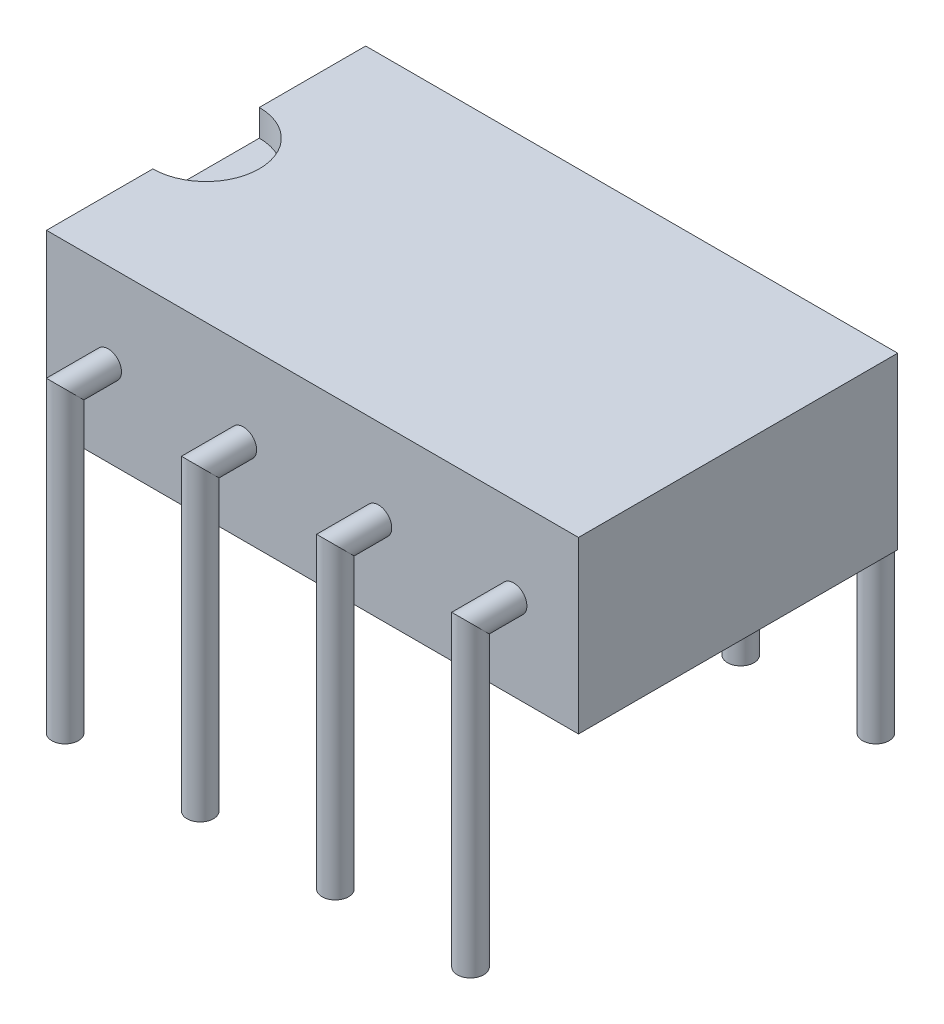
ISO-10303-21;
HEADER;
FILE_DESCRIPTION(('STEP AP214'),'2;1');
FILE_NAME('part.step','',(''),(''),'','','');
FILE_SCHEMA(('AUTOMOTIVE_DESIGN { 1 0 10303 214 1 1 1 1 }'));
ENDSEC;
DATA;
#1=APPLICATION_CONTEXT('core data for automotive mechanical design processes');
#2=APPLICATION_PROTOCOL_DEFINITION('international standard','automotive_design',2000,#1);
#3=PRODUCT_CONTEXT('',#1,'mechanical');
#4=PRODUCT('Part','Part','',(#3));
#5=PRODUCT_RELATED_PRODUCT_CATEGORY('part','',(#4));
#6=PRODUCT_DEFINITION_FORMATION('','',#4);
#7=PRODUCT_DEFINITION_CONTEXT('part definition',#1,'design');
#8=PRODUCT_DEFINITION('design','',#6,#7);
#9=PRODUCT_DEFINITION_SHAPE('','',#8);
#10=(LENGTH_UNIT() NAMED_UNIT(*) SI_UNIT(.MILLI.,.METRE.));
#11=(NAMED_UNIT(*) PLANE_ANGLE_UNIT() SI_UNIT($,.RADIAN.));
#12=(NAMED_UNIT(*) SI_UNIT($,.STERADIAN.) SOLID_ANGLE_UNIT());
#13=UNCERTAINTY_MEASURE_WITH_UNIT(LENGTH_MEASURE(1.E-05),#10,'distance_accuracy_value','');
#14=(GEOMETRIC_REPRESENTATION_CONTEXT(3) GLOBAL_UNCERTAINTY_ASSIGNED_CONTEXT((#13)) GLOBAL_UNIT_ASSIGNED_CONTEXT((#10,
#11,#12)) REPRESENTATION_CONTEXT('',''));
#15=CARTESIAN_POINT('',(0.,0.,0.));
#16=DIRECTION('',(0.,0.,1.));
#17=DIRECTION('',(1.,0.,0.));
#18=AXIS2_PLACEMENT_3D('',#15,#16,#17);
#19=CARTESIAN_POINT('',(10.,3.2,3.));
#20=DIRECTION('',(0.,0.,-1.));
#21=DIRECTION('',(-1.,0.,0.));
#22=AXIS2_PLACEMENT_3D('',#19,#20,#21);
#23=PLANE('',#22);
#24=CARTESIAN_POINT('',(6.24,1.6,3.));
#25=DIRECTION('',(0.,0.,-1.));
#26=DIRECTION('',(-1.,0.,0.));
#27=AXIS2_PLACEMENT_3D('',#24,#25,#26);
#28=CIRCLE('',#27,0.25);
#29=CARTESIAN_POINT('',(5.99,1.6,3.));
#30=VERTEX_POINT('',#29);
#31=EDGE_CURVE('E47',#30,#30,#28,.F.);
#32=ORIENTED_EDGE('',*,*,#31,.F.);
#33=EDGE_LOOP('',(#32));
#34=FACE_BOUND('',#33,.T.);
#35=CARTESIAN_POINT('',(1.16,1.6,3.));
#36=DIRECTION('',(0.,0.,-1.));
#37=DIRECTION('',(-1.,0.,0.));
#38=AXIS2_PLACEMENT_3D('',#35,#36,#37);
#39=CIRCLE('',#38,0.25);
#40=CARTESIAN_POINT('',(0.91,1.6,3.));
#41=VERTEX_POINT('',#40);
#42=EDGE_CURVE('E144',#41,#41,#39,.F.);
#43=ORIENTED_EDGE('',*,*,#42,.F.);
#44=EDGE_LOOP('',(#43));
#45=FACE_BOUND('',#44,.T.);
#46=DIRECTION('',(0.,-1.,0.));
#47=VECTOR('',#46,1.);
#48=CARTESIAN_POINT('',(0.,3.2,3.));
#49=LINE('',#48,#47);
#50=CARTESIAN_POINT('',(0.,3.2,3.));
#51=VERTEX_POINT('',#50);
#52=CARTESIAN_POINT('',(0.,0.,3.));
#53=VERTEX_POINT('',#52);
#54=EDGE_CURVE('E114',#51,#53,#49,.T.);
#55=ORIENTED_EDGE('',*,*,#54,.T.);
#56=DIRECTION('',(-1.,0.,0.));
#57=VECTOR('',#56,1.);
#58=CARTESIAN_POINT('',(10.,0.,3.));
#59=LINE('',#58,#57);
#60=CARTESIAN_POINT('',(10.,0.,3.));
#61=VERTEX_POINT('',#60);
#62=EDGE_CURVE('E142',#61,#53,#59,.T.);
#63=ORIENTED_EDGE('',*,*,#62,.F.);
#64=DIRECTION('',(0.,-1.,0.));
#65=VECTOR('',#64,1.);
#66=CARTESIAN_POINT('',(10.,3.2,3.));
#67=LINE('',#66,#65);
#68=CARTESIAN_POINT('',(10.,3.2,3.));
#69=VERTEX_POINT('',#68);
#70=EDGE_CURVE('E122',#69,#61,#67,.T.);
#71=ORIENTED_EDGE('',*,*,#70,.F.);
#72=DIRECTION('',(-1.,0.,0.));
#73=VECTOR('',#72,1.);
#74=CARTESIAN_POINT('',(10.,3.2,3.));
#75=LINE('',#74,#73);
#76=EDGE_CURVE('E128',#69,#51,#75,.T.);
#77=ORIENTED_EDGE('',*,*,#76,.T.);
#78=EDGE_LOOP('',(#55,#63,#71,#77));
#79=FACE_BOUND('',#78,.T.);
#80=CARTESIAN_POINT('',(3.7,1.6,3.));
#81=DIRECTION('',(0.,0.,-1.));
#82=DIRECTION('',(-1.,0.,0.));
#83=AXIS2_PLACEMENT_3D('',#80,#81,#82);
#84=CIRCLE('',#83,0.25);
#85=CARTESIAN_POINT('',(3.45,1.6,3.));
#86=VERTEX_POINT('',#85);
#87=EDGE_CURVE('E147',#86,#86,#84,.F.);
#88=ORIENTED_EDGE('',*,*,#87,.F.);
#89=EDGE_LOOP('',(#88));
#90=FACE_BOUND('',#89,.T.);
#91=CARTESIAN_POINT('',(8.78,1.6,3.));
#92=DIRECTION('',(0.,0.,-1.));
#93=DIRECTION('',(-1.,0.,0.));
#94=AXIS2_PLACEMENT_3D('',#91,#92,#93);
#95=CIRCLE('',#94,0.25);
#96=CARTESIAN_POINT('',(8.53,1.6,3.));
#97=VERTEX_POINT('',#96);
#98=EDGE_CURVE('E12',#97,#97,#95,.F.);
#99=ORIENTED_EDGE('',*,*,#98,.F.);
#100=EDGE_LOOP('',(#99));
#101=FACE_BOUND('',#100,.T.);
#102=ADVANCED_FACE('F40',(#34,#45,#79,#90,#101),#23,.F.);
#103=CARTESIAN_POINT('',(10.,0.,3.));
#104=DIRECTION('',(0.,1.,0.));
#105=DIRECTION('',(0.,0.,1.));
#106=AXIS2_PLACEMENT_3D('',#103,#104,#105);
#107=PLANE('',#106);
#108=DIRECTION('',(0.,0.,-1.));
#109=VECTOR('',#108,1.);
#110=CARTESIAN_POINT('',(0.,0.,3.));
#111=LINE('',#110,#109);
#112=CARTESIAN_POINT('',(0.,0.,-3.));
#113=VERTEX_POINT('',#112);
#114=EDGE_CURVE('E117',#53,#113,#111,.T.);
#115=ORIENTED_EDGE('',*,*,#114,.T.);
#116=DIRECTION('',(-1.,0.,0.));
#117=VECTOR('',#116,1.);
#118=CARTESIAN_POINT('',(10.,0.,-3.));
#119=LINE('',#118,#117);
#120=CARTESIAN_POINT('',(10.,0.,-3.));
#121=VERTEX_POINT('',#120);
#122=EDGE_CURVE('E139',#121,#113,#119,.T.);
#123=ORIENTED_EDGE('',*,*,#122,.F.);
#124=DIRECTION('',(0.,0.,-1.));
#125=VECTOR('',#124,1.);
#126=CARTESIAN_POINT('',(10.,0.,3.));
#127=LINE('',#126,#125);
#128=EDGE_CURVE('E91',#61,#121,#127,.T.);
#129=ORIENTED_EDGE('',*,*,#128,.F.);
#130=ORIENTED_EDGE('',*,*,#62,.T.);
#131=EDGE_LOOP('',(#115,#123,#129,#130));
#132=FACE_BOUND('',#131,.T.);
#133=ADVANCED_FACE('F157',(#132),#107,.F.);
#134=CARTESIAN_POINT('',(10.,3.2,-3.));
#135=DIRECTION('',(0.,0.,1.));
#136=DIRECTION('',(1.,0.,0.));
#137=AXIS2_PLACEMENT_3D('',#134,#135,#136);
#138=PLANE('',#137);
#139=CARTESIAN_POINT('',(8.78,1.6,-3.));
#140=DIRECTION('',(0.,0.,1.));
#141=DIRECTION('',(1.,0.,0.));
#142=AXIS2_PLACEMENT_3D('',#139,#140,#141);
#143=CIRCLE('',#142,0.25);
#144=CARTESIAN_POINT('',(9.03,1.6,-3.));
#145=VERTEX_POINT('',#144);
#146=EDGE_CURVE('E521',#145,#145,#143,.T.);
#147=ORIENTED_EDGE('',*,*,#146,.T.);
#148=EDGE_LOOP('',(#147));
#149=FACE_BOUND('',#148,.T.);
#150=CARTESIAN_POINT('',(6.24,1.6,-3.));
#151=DIRECTION('',(0.,0.,1.));
#152=DIRECTION('',(1.,0.,0.));
#153=AXIS2_PLACEMENT_3D('',#150,#151,#152);
#154=CIRCLE('',#153,0.25);
#155=CARTESIAN_POINT('',(6.49,1.6,-3.));
#156=VERTEX_POINT('',#155);
#157=EDGE_CURVE('E514',#156,#156,#154,.T.);
#158=ORIENTED_EDGE('',*,*,#157,.T.);
#159=EDGE_LOOP('',(#158));
#160=FACE_BOUND('',#159,.T.);
#161=CARTESIAN_POINT('',(3.7,1.6,-3.));
#162=DIRECTION('',(0.,0.,1.));
#163=DIRECTION('',(1.,0.,0.));
#164=AXIS2_PLACEMENT_3D('',#161,#162,#163);
#165=CIRCLE('',#164,0.25);
#166=CARTESIAN_POINT('',(3.95,1.6,-3.));
#167=VERTEX_POINT('',#166);
#168=EDGE_CURVE('E530',#167,#167,#165,.T.);
#169=ORIENTED_EDGE('',*,*,#168,.T.);
#170=EDGE_LOOP('',(#169));
#171=FACE_BOUND('',#170,.T.);
#172=CARTESIAN_POINT('',(1.16,1.6,-3.));
#173=DIRECTION('',(0.,0.,1.));
#174=DIRECTION('',(1.,0.,0.));
#175=AXIS2_PLACEMENT_3D('',#172,#173,#174);
#176=CIRCLE('',#175,0.25);
#177=CARTESIAN_POINT('',(1.41,1.6,-3.));
#178=VERTEX_POINT('',#177);
#179=EDGE_CURVE('E198',#178,#178,#176,.T.);
#180=ORIENTED_EDGE('',*,*,#179,.T.);
#181=EDGE_LOOP('',(#180));
#182=FACE_BOUND('',#181,.T.);
#183=DIRECTION('',(0.,1.,0.));
#184=VECTOR('',#183,1.);
#185=CARTESIAN_POINT('',(0.,3.2,-3.));
#186=LINE('',#185,#184);
#187=CARTESIAN_POINT('',(0.,3.2,-3.));
#188=VERTEX_POINT('',#187);
#189=EDGE_CURVE('E131',#113,#188,#186,.T.);
#190=ORIENTED_EDGE('',*,*,#189,.T.);
#191=DIRECTION('',(-1.,0.,0.));
#192=VECTOR('',#191,1.);
#193=CARTESIAN_POINT('',(10.,3.2,-3.));
#194=LINE('',#193,#192);
#195=CARTESIAN_POINT('',(10.,3.2,-3.));
#196=VERTEX_POINT('',#195);
#197=EDGE_CURVE('E136',#196,#188,#194,.T.);
#198=ORIENTED_EDGE('',*,*,#197,.F.);
#199=DIRECTION('',(0.,1.,0.));
#200=VECTOR('',#199,1.);
#201=CARTESIAN_POINT('',(10.,3.2,-3.));
#202=LINE('',#201,#200);
#203=EDGE_CURVE('E126',#121,#196,#202,.T.);
#204=ORIENTED_EDGE('',*,*,#203,.F.);
#205=ORIENTED_EDGE('',*,*,#122,.T.);
#206=EDGE_LOOP('',(#190,#198,#204,#205));
#207=FACE_BOUND('',#206,.T.);
#208=ADVANCED_FACE('F220',(#149,#160,#171,#182,#207),#138,.F.);
#209=CARTESIAN_POINT('',(10.,3.2,3.));
#210=DIRECTION('',(0.,-1.,0.));
#211=DIRECTION('',(0.,0.,-1.));
#212=AXIS2_PLACEMENT_3D('',#209,#210,#211);
#213=PLANE('',#212);
#214=DIRECTION('',(0.,0.,1.));
#215=VECTOR('',#214,1.);
#216=CARTESIAN_POINT('',(0.,3.2,3.));
#217=LINE('',#216,#215);
#218=CARTESIAN_POINT('',(0.,3.2,-1.));
#219=VERTEX_POINT('',#218);
#220=EDGE_CURVE('E124',#188,#219,#217,.T.);
#221=ORIENTED_EDGE('',*,*,#220,.T.);
#222=CARTESIAN_POINT('',(0.,3.2,0.));
#223=DIRECTION('',(0.,1.,0.));
#224=DIRECTION('',(0.,0.,1.));
#225=AXIS2_PLACEMENT_3D('',#222,#223,#224);
#226=CIRCLE('',#225,1.);
#227=CARTESIAN_POINT('',(0.,3.2,1.));
#228=VERTEX_POINT('',#227);
#229=EDGE_CURVE('E107',#228,#219,#226,.T.);
#230=ORIENTED_EDGE('',*,*,#229,.F.);
#231=EDGE_CURVE('E83',#228,#51,#217,.T.);
#232=ORIENTED_EDGE('',*,*,#231,.T.);
#233=ORIENTED_EDGE('',*,*,#76,.F.);
#234=DIRECTION('',(0.,0.,1.));
#235=VECTOR('',#234,1.);
#236=CARTESIAN_POINT('',(10.,3.2,3.));
#237=LINE('',#236,#235);
#238=EDGE_CURVE('E62',#196,#69,#237,.T.);
#239=ORIENTED_EDGE('',*,*,#238,.F.);
#240=ORIENTED_EDGE('',*,*,#197,.T.);
#241=EDGE_LOOP('',(#221,#230,#232,#233,#239,#240));
#242=FACE_BOUND('',#241,.T.);
#243=ADVANCED_FACE('F216',(#242),#213,.F.);
#244=CARTESIAN_POINT('',(10.,0.,3.));
#245=DIRECTION('',(1.,0.,0.));
#246=DIRECTION('',(0.,0.,-1.));
#247=AXIS2_PLACEMENT_3D('',#244,#245,#246);
#248=PLANE('',#247);
#249=ORIENTED_EDGE('',*,*,#70,.T.);
#250=ORIENTED_EDGE('',*,*,#128,.T.);
#251=ORIENTED_EDGE('',*,*,#203,.T.);
#252=ORIENTED_EDGE('',*,*,#238,.T.);
#253=EDGE_LOOP('',(#249,#250,#251,#252));
#254=FACE_BOUND('',#253,.T.);
#255=ADVANCED_FACE('F222',(#254),#248,.T.);
#256=CARTESIAN_POINT('',(0.,0.,3.));
#257=DIRECTION('',(1.,0.,0.));
#258=DIRECTION('',(0.,0.,-1.));
#259=AXIS2_PLACEMENT_3D('',#256,#257,#258);
#260=PLANE('',#259);
#261=DIRECTION('',(0.,0.,1.));
#262=VECTOR('',#261,1.);
#263=CARTESIAN_POINT('',(0.,2.7,-1.));
#264=LINE('',#263,#262);
#265=CARTESIAN_POINT('',(0.,2.7,-1.));
#266=VERTEX_POINT('',#265);
#267=CARTESIAN_POINT('',(0.,2.7,1.));
#268=VERTEX_POINT('',#267);
#269=EDGE_CURVE('E106',#266,#268,#264,.T.);
#270=ORIENTED_EDGE('',*,*,#269,.F.);
#271=DIRECTION('',(0.,1.,0.));
#272=VECTOR('',#271,1.);
#273=CARTESIAN_POINT('',(0.,2.7,-1.));
#274=LINE('',#273,#272);
#275=EDGE_CURVE('E104',#266,#219,#274,.T.);
#276=ORIENTED_EDGE('',*,*,#275,.T.);
#277=ORIENTED_EDGE('',*,*,#220,.F.);
#278=ORIENTED_EDGE('',*,*,#189,.F.);
#279=ORIENTED_EDGE('',*,*,#114,.F.);
#280=ORIENTED_EDGE('',*,*,#54,.F.);
#281=ORIENTED_EDGE('',*,*,#231,.F.);
#282=DIRECTION('',(0.,1.,0.));
#283=VECTOR('',#282,1.);
#284=CARTESIAN_POINT('',(0.,2.7,1.));
#285=LINE('',#284,#283);
#286=EDGE_CURVE('E102',#268,#228,#285,.T.);
#287=ORIENTED_EDGE('',*,*,#286,.F.);
#288=EDGE_LOOP('',(#270,#276,#277,#278,#279,#280,#281,#287));
#289=FACE_BOUND('',#288,.T.);
#290=ADVANCED_FACE('F112',(#289),#260,.F.);
#291=CARTESIAN_POINT('',(0.,2.7,0.));
#292=DIRECTION('',(0.,1.,0.));
#293=DIRECTION('',(0.,0.,1.));
#294=AXIS2_PLACEMENT_3D('',#291,#292,#293);
#295=CYLINDRICAL_SURFACE('',#294,1.);
#296=ORIENTED_EDGE('',*,*,#229,.T.);
#297=ORIENTED_EDGE('',*,*,#275,.F.);
#298=CARTESIAN_POINT('',(0.,2.7,0.));
#299=DIRECTION('',(0.,1.,0.));
#300=DIRECTION('',(0.,0.,1.));
#301=AXIS2_PLACEMENT_3D('',#298,#299,#300);
#302=CIRCLE('',#301,1.);
#303=EDGE_CURVE('E53',#268,#266,#302,.T.);
#304=ORIENTED_EDGE('',*,*,#303,.F.);
#305=ORIENTED_EDGE('',*,*,#286,.T.);
#306=EDGE_LOOP('',(#296,#297,#304,#305));
#307=FACE_BOUND('',#306,.T.);
#308=ADVANCED_FACE('F100',(#307),#295,.F.);
#309=CARTESIAN_POINT('',(0.,2.7,0.));
#310=DIRECTION('',(0.,1.,0.));
#311=DIRECTION('',(0.,0.,1.));
#312=AXIS2_PLACEMENT_3D('',#309,#310,#311);
#313=PLANE('',#312);
#314=ORIENTED_EDGE('',*,*,#303,.T.);
#315=ORIENTED_EDGE('',*,*,#269,.T.);
#316=EDGE_LOOP('',(#314,#315));
#317=FACE_BOUND('',#316,.T.);
#318=ADVANCED_FACE('F109',(#317),#313,.T.);
#319=CARTESIAN_POINT('',(1.16,1.6,3.81));
#320=DIRECTION('',(0.,-1.,0.));
#321=DIRECTION('',(0.,0.,-1.));
#322=AXIS2_PLACEMENT_3D('',#319,#320,#321);
#323=CYLINDRICAL_SURFACE('',#322,0.25);
#324=CARTESIAN_POINT('',(1.16,1.6,3.81));
#325=DIRECTION('',(0.,-0.707106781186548,0.707106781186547));
#326=DIRECTION('',(0.,-0.707106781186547,-0.707106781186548));
#327=AXIS2_PLACEMENT_3D('',#324,#325,#326);
#328=ELLIPSE('',#327,0.353553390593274,0.25);
#329=CARTESIAN_POINT('',(1.16,1.35,3.56));
#330=VERTEX_POINT('',#329);
#331=EDGE_CURVE('E207',#330,#330,#328,.T.);
#332=ORIENTED_EDGE('',*,*,#331,.T.);
#333=EDGE_LOOP('',(#332));
#334=FACE_BOUND('',#333,.T.);
#335=CARTESIAN_POINT('',(1.16,-4.,3.81));
#336=DIRECTION('',(0.,-1.,0.));
#337=DIRECTION('',(0.,0.,-1.));
#338=AXIS2_PLACEMENT_3D('',#335,#336,#337);
#339=CIRCLE('',#338,0.25);
#340=CARTESIAN_POINT('',(1.16,-4.,3.56));
#341=VERTEX_POINT('',#340);
#342=EDGE_CURVE('E210',#341,#341,#339,.F.);
#343=ORIENTED_EDGE('',*,*,#342,.T.);
#344=EDGE_LOOP('',(#343));
#345=FACE_BOUND('',#344,.T.);
#346=ADVANCED_FACE('F274',(#334,#345),#323,.T.);
#347=CARTESIAN_POINT('',(1.16,1.6,4.51710678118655));
#348=DIRECTION('',(0.,0.,-1.));
#349=DIRECTION('',(0.,1.,0.));
#350=AXIS2_PLACEMENT_3D('',#347,#348,#349);
#351=CYLINDRICAL_SURFACE('',#350,0.25);
#352=ORIENTED_EDGE('',*,*,#42,.T.);
#353=EDGE_LOOP('',(#352));
#354=FACE_BOUND('',#353,.T.);
#355=ORIENTED_EDGE('',*,*,#331,.F.);
#356=EDGE_LOOP('',(#355));
#357=FACE_BOUND('',#356,.T.);
#358=ADVANCED_FACE('F282',(#354,#357),#351,.T.);
#359=CARTESIAN_POINT('',(1.16,-4.,3.81));
#360=DIRECTION('',(0.,-1.,0.));
#361=DIRECTION('',(0.,0.,-1.));
#362=AXIS2_PLACEMENT_3D('',#359,#360,#361);
#363=PLANE('',#362);
#364=ORIENTED_EDGE('',*,*,#342,.F.);
#365=EDGE_LOOP('',(#364));
#366=FACE_BOUND('',#365,.T.);
#367=ADVANCED_FACE('F292',(#366),#363,.T.);
#368=CARTESIAN_POINT('',(1.16,1.6,-3.81));
#369=DIRECTION('',(0.,-1.,0.));
#370=DIRECTION('',(0.,0.,-1.));
#371=AXIS2_PLACEMENT_3D('',#368,#369,#370);
#372=CYLINDRICAL_SURFACE('',#371,0.25);
#373=CARTESIAN_POINT('',(1.16,1.6,-3.81));
#374=DIRECTION('',(0.,-0.707106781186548,-0.707106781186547));
#375=DIRECTION('',(0.,-0.707106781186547,0.707106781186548));
#376=AXIS2_PLACEMENT_3D('',#373,#374,#375);
#377=ELLIPSE('',#376,0.353553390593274,0.25);
#378=CARTESIAN_POINT('',(1.16,1.35,-3.56));
#379=VERTEX_POINT('',#378);
#380=EDGE_CURVE('E201',#379,#379,#377,.F.);
#381=ORIENTED_EDGE('',*,*,#380,.F.);
#382=EDGE_LOOP('',(#381));
#383=FACE_BOUND('',#382,.T.);
#384=CARTESIAN_POINT('',(1.16,-4.,-3.81));
#385=DIRECTION('',(0.,-1.,0.));
#386=DIRECTION('',(0.,0.,-1.));
#387=AXIS2_PLACEMENT_3D('',#384,#385,#386);
#388=CIRCLE('',#387,0.25);
#389=CARTESIAN_POINT('',(1.16,-4.,-4.06));
#390=VERTEX_POINT('',#389);
#391=EDGE_CURVE('E204',#390,#390,#388,.T.);
#392=ORIENTED_EDGE('',*,*,#391,.F.);
#393=EDGE_LOOP('',(#392));
#394=FACE_BOUND('',#393,.T.);
#395=ADVANCED_FACE('F302',(#383,#394),#372,.T.);
#396=CARTESIAN_POINT('',(1.16,1.6,-4.51710678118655));
#397=DIRECTION('',(0.,0.,1.));
#398=DIRECTION('',(0.,-1.,0.));
#399=AXIS2_PLACEMENT_3D('',#396,#397,#398);
#400=CYLINDRICAL_SURFACE('',#399,0.25);
#401=ORIENTED_EDGE('',*,*,#179,.F.);
#402=EDGE_LOOP('',(#401));
#403=FACE_BOUND('',#402,.T.);
#404=ORIENTED_EDGE('',*,*,#380,.T.);
#405=EDGE_LOOP('',(#404));
#406=FACE_BOUND('',#405,.T.);
#407=ADVANCED_FACE('F312',(#403,#406),#400,.T.);
#408=CARTESIAN_POINT('',(1.16,-4.,-3.81));
#409=DIRECTION('',(0.,-1.,0.));
#410=DIRECTION('',(0.,0.,-1.));
#411=AXIS2_PLACEMENT_3D('',#408,#409,#410);
#412=PLANE('',#411);
#413=ORIENTED_EDGE('',*,*,#391,.T.);
#414=EDGE_LOOP('',(#413));
#415=FACE_BOUND('',#414,.T.);
#416=ADVANCED_FACE('F322',(#415),#412,.T.);
#417=CARTESIAN_POINT('',(3.7,1.6,3.81));
#418=DIRECTION('',(0.,-1.,0.));
#419=DIRECTION('',(0.,0.,-1.));
#420=AXIS2_PLACEMENT_3D('',#417,#418,#419);
#421=CYLINDRICAL_SURFACE('',#420,0.25);
#422=CARTESIAN_POINT('',(3.7,1.6,3.81));
#423=DIRECTION('',(0.,-0.707106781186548,0.707106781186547));
#424=DIRECTION('',(0.,-0.707106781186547,-0.707106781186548));
#425=AXIS2_PLACEMENT_3D('',#422,#423,#424);
#426=ELLIPSE('',#425,0.353553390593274,0.25);
#427=CARTESIAN_POINT('',(3.7,1.35,3.56));
#428=VERTEX_POINT('',#427);
#429=EDGE_CURVE('E192',#428,#428,#426,.T.);
#430=ORIENTED_EDGE('',*,*,#429,.T.);
#431=EDGE_LOOP('',(#430));
#432=FACE_BOUND('',#431,.T.);
#433=CARTESIAN_POINT('',(3.7,-4.,3.81));
#434=DIRECTION('',(0.,-1.,0.));
#435=DIRECTION('',(0.,0.,-1.));
#436=AXIS2_PLACEMENT_3D('',#433,#434,#435);
#437=CIRCLE('',#436,0.25);
#438=CARTESIAN_POINT('',(3.7,-4.,3.56));
#439=VERTEX_POINT('',#438);
#440=EDGE_CURVE('E195',#439,#439,#437,.F.);
#441=ORIENTED_EDGE('',*,*,#440,.T.);
#442=EDGE_LOOP('',(#441));
#443=FACE_BOUND('',#442,.T.);
#444=ADVANCED_FACE('F331',(#432,#443),#421,.T.);
#445=CARTESIAN_POINT('',(3.7,1.6,4.51710678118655));
#446=DIRECTION('',(0.,0.,-1.));
#447=DIRECTION('',(0.,1.,0.));
#448=AXIS2_PLACEMENT_3D('',#445,#446,#447);
#449=CYLINDRICAL_SURFACE('',#448,0.25);
#450=ORIENTED_EDGE('',*,*,#87,.T.);
#451=EDGE_LOOP('',(#450));
#452=FACE_BOUND('',#451,.T.);
#453=ORIENTED_EDGE('',*,*,#429,.F.);
#454=EDGE_LOOP('',(#453));
#455=FACE_BOUND('',#454,.T.);
#456=ADVANCED_FACE('F346',(#452,#455),#449,.T.);
#457=CARTESIAN_POINT('',(3.7,-4.,3.81));
#458=DIRECTION('',(0.,-1.,0.));
#459=DIRECTION('',(0.,0.,-1.));
#460=AXIS2_PLACEMENT_3D('',#457,#458,#459);
#461=PLANE('',#460);
#462=ORIENTED_EDGE('',*,*,#440,.F.);
#463=EDGE_LOOP('',(#462));
#464=FACE_BOUND('',#463,.T.);
#465=ADVANCED_FACE('F355',(#464),#461,.T.);
#466=CARTESIAN_POINT('',(6.24,1.6,3.81));
#467=DIRECTION('',(0.,-1.,0.));
#468=DIRECTION('',(0.,0.,-1.));
#469=AXIS2_PLACEMENT_3D('',#466,#467,#468);
#470=CYLINDRICAL_SURFACE('',#469,0.25);
#471=CARTESIAN_POINT('',(6.24,1.6,3.81));
#472=DIRECTION('',(0.,-0.707106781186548,0.707106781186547));
#473=DIRECTION('',(0.,-0.707106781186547,-0.707106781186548));
#474=AXIS2_PLACEMENT_3D('',#471,#472,#473);
#475=ELLIPSE('',#474,0.353553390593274,0.25);
#476=CARTESIAN_POINT('',(6.24,1.35,3.56));
#477=VERTEX_POINT('',#476);
#478=EDGE_CURVE('E180',#477,#477,#475,.T.);
#479=ORIENTED_EDGE('',*,*,#478,.T.);
#480=EDGE_LOOP('',(#479));
#481=FACE_BOUND('',#480,.T.);
#482=CARTESIAN_POINT('',(6.24,-4.,3.81));
#483=DIRECTION('',(0.,-1.,0.));
#484=DIRECTION('',(0.,0.,-1.));
#485=AXIS2_PLACEMENT_3D('',#482,#483,#484);
#486=CIRCLE('',#485,0.25);
#487=CARTESIAN_POINT('',(6.24,-4.,3.56));
#488=VERTEX_POINT('',#487);
#489=EDGE_CURVE('E189',#488,#488,#486,.F.);
#490=ORIENTED_EDGE('',*,*,#489,.T.);
#491=EDGE_LOOP('',(#490));
#492=FACE_BOUND('',#491,.T.);
#493=ADVANCED_FACE('F364',(#481,#492),#470,.T.);
#494=CARTESIAN_POINT('',(6.24,1.6,4.51710678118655));
#495=DIRECTION('',(0.,0.,-1.));
#496=DIRECTION('',(0.,1.,0.));
#497=AXIS2_PLACEMENT_3D('',#494,#495,#496);
#498=CYLINDRICAL_SURFACE('',#497,0.25);
#499=ORIENTED_EDGE('',*,*,#31,.T.);
#500=EDGE_LOOP('',(#499));
#501=FACE_BOUND('',#500,.T.);
#502=ORIENTED_EDGE('',*,*,#478,.F.);
#503=EDGE_LOOP('',(#502));
#504=FACE_BOUND('',#503,.T.);
#505=ADVANCED_FACE('F152',(#501,#504),#498,.T.);
#506=CARTESIAN_POINT('',(6.24,-4.,3.81));
#507=DIRECTION('',(0.,-1.,0.));
#508=DIRECTION('',(0.,0.,-1.));
#509=AXIS2_PLACEMENT_3D('',#506,#507,#508);
#510=PLANE('',#509);
#511=ORIENTED_EDGE('',*,*,#489,.F.);
#512=EDGE_LOOP('',(#511));
#513=FACE_BOUND('',#512,.T.);
#514=ADVANCED_FACE('F381',(#513),#510,.T.);
#515=CARTESIAN_POINT('',(8.78,1.6,3.81));
#516=DIRECTION('',(0.,-1.,0.));
#517=DIRECTION('',(0.,0.,-1.));
#518=AXIS2_PLACEMENT_3D('',#515,#516,#517);
#519=CYLINDRICAL_SURFACE('',#518,0.25);
#520=CARTESIAN_POINT('',(8.78,1.6,3.81));
#521=DIRECTION('',(0.,-0.707106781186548,0.707106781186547));
#522=DIRECTION('',(0.,-0.707106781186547,-0.707106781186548));
#523=AXIS2_PLACEMENT_3D('',#520,#521,#522);
#524=ELLIPSE('',#523,0.353553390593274,0.25);
#525=CARTESIAN_POINT('',(8.78,1.35,3.56));
#526=VERTEX_POINT('',#525);
#527=EDGE_CURVE('E174',#526,#526,#524,.T.);
#528=ORIENTED_EDGE('',*,*,#527,.T.);
#529=EDGE_LOOP('',(#528));
#530=FACE_BOUND('',#529,.T.);
#531=CARTESIAN_POINT('',(8.78,-4.,3.81));
#532=DIRECTION('',(0.,-1.,0.));
#533=DIRECTION('',(0.,0.,-1.));
#534=AXIS2_PLACEMENT_3D('',#531,#532,#533);
#535=CIRCLE('',#534,0.25);
#536=CARTESIAN_POINT('',(8.78,-4.,3.56));
#537=VERTEX_POINT('',#536);
#538=EDGE_CURVE('E176',#537,#537,#535,.F.);
#539=ORIENTED_EDGE('',*,*,#538,.T.);
#540=EDGE_LOOP('',(#539));
#541=FACE_BOUND('',#540,.T.);
#542=ADVANCED_FACE('F170',(#530,#541),#519,.T.);
#543=CARTESIAN_POINT('',(8.78,1.6,4.51710678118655));
#544=DIRECTION('',(0.,0.,-1.));
#545=DIRECTION('',(0.,1.,0.));
#546=AXIS2_PLACEMENT_3D('',#543,#544,#545);
#547=CYLINDRICAL_SURFACE('',#546,0.25);
#548=ORIENTED_EDGE('',*,*,#98,.T.);
#549=EDGE_LOOP('',(#548));
#550=FACE_BOUND('',#549,.T.);
#551=ORIENTED_EDGE('',*,*,#527,.F.);
#552=EDGE_LOOP('',(#551));
#553=FACE_BOUND('',#552,.T.);
#554=ADVANCED_FACE('F166',(#550,#553),#547,.T.);
#555=CARTESIAN_POINT('',(8.78,-4.,3.81));
#556=DIRECTION('',(0.,-1.,0.));
#557=DIRECTION('',(0.,0.,-1.));
#558=AXIS2_PLACEMENT_3D('',#555,#556,#557);
#559=PLANE('',#558);
#560=ORIENTED_EDGE('',*,*,#538,.F.);
#561=EDGE_LOOP('',(#560));
#562=FACE_BOUND('',#561,.T.);
#563=ADVANCED_FACE('F169',(#562),#559,.T.);
#564=CARTESIAN_POINT('',(3.7,1.6,-3.81));
#565=DIRECTION('',(0.,-1.,0.));
#566=DIRECTION('',(0.,0.,-1.));
#567=AXIS2_PLACEMENT_3D('',#564,#565,#566);
#568=CYLINDRICAL_SURFACE('',#567,0.25);
#569=CARTESIAN_POINT('',(3.7,1.6,-3.81));
#570=DIRECTION('',(0.,-0.707106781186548,-0.707106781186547));
#571=DIRECTION('',(0.,-0.707106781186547,0.707106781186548));
#572=AXIS2_PLACEMENT_3D('',#569,#570,#571);
#573=ELLIPSE('',#572,0.353553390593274,0.25);
#574=CARTESIAN_POINT('',(3.7,1.35,-3.56));
#575=VERTEX_POINT('',#574);
#576=EDGE_CURVE('E183',#575,#575,#573,.F.);
#577=ORIENTED_EDGE('',*,*,#576,.F.);
#578=EDGE_LOOP('',(#577));
#579=FACE_BOUND('',#578,.T.);
#580=CARTESIAN_POINT('',(3.7,-4.,-3.81));
#581=DIRECTION('',(0.,-1.,0.));
#582=DIRECTION('',(0.,0.,-1.));
#583=AXIS2_PLACEMENT_3D('',#580,#581,#582);
#584=CIRCLE('',#583,0.25);
#585=CARTESIAN_POINT('',(3.7,-4.,-4.06));
#586=VERTEX_POINT('',#585);
#587=EDGE_CURVE('E177',#586,#586,#584,.T.);
#588=ORIENTED_EDGE('',*,*,#587,.F.);
#589=EDGE_LOOP('',(#588));
#590=FACE_BOUND('',#589,.T.);
#591=ADVANCED_FACE('F409',(#579,#590),#568,.T.);
#592=CARTESIAN_POINT('',(3.7,1.6,-4.51710678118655));
#593=DIRECTION('',(0.,0.,1.));
#594=DIRECTION('',(0.,-1.,0.));
#595=AXIS2_PLACEMENT_3D('',#592,#593,#594);
#596=CYLINDRICAL_SURFACE('',#595,0.25);
#597=ORIENTED_EDGE('',*,*,#168,.F.);
#598=EDGE_LOOP('',(#597));
#599=FACE_BOUND('',#598,.T.);
#600=ORIENTED_EDGE('',*,*,#576,.T.);
#601=EDGE_LOOP('',(#600));
#602=FACE_BOUND('',#601,.T.);
#603=ADVANCED_FACE('F418',(#599,#602),#596,.T.);
#604=CARTESIAN_POINT('',(3.7,-4.,-3.81));
#605=DIRECTION('',(0.,-1.,0.));
#606=DIRECTION('',(0.,0.,-1.));
#607=AXIS2_PLACEMENT_3D('',#604,#605,#606);
#608=PLANE('',#607);
#609=ORIENTED_EDGE('',*,*,#587,.T.);
#610=EDGE_LOOP('',(#609));
#611=FACE_BOUND('',#610,.T.);
#612=ADVANCED_FACE('F427',(#611),#608,.T.);
#613=CARTESIAN_POINT('',(6.24,1.6,-3.81));
#614=DIRECTION('',(0.,-1.,0.));
#615=DIRECTION('',(0.,0.,-1.));
#616=AXIS2_PLACEMENT_3D('',#613,#614,#615);
#617=CYLINDRICAL_SURFACE('',#616,0.25);
#618=CARTESIAN_POINT('',(6.24,1.6,-3.81));
#619=DIRECTION('',(0.,-0.707106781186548,-0.707106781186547));
#620=DIRECTION('',(0.,-0.707106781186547,0.707106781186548));
#621=AXIS2_PLACEMENT_3D('',#618,#619,#620);
#622=ELLIPSE('',#621,0.353553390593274,0.25);
#623=CARTESIAN_POINT('',(6.24,1.35,-3.56));
#624=VERTEX_POINT('',#623);
#625=EDGE_CURVE('E518',#624,#624,#622,.F.);
#626=ORIENTED_EDGE('',*,*,#625,.F.);
#627=EDGE_LOOP('',(#626));
#628=FACE_BOUND('',#627,.T.);
#629=CARTESIAN_POINT('',(6.24,-4.,-3.81));
#630=DIRECTION('',(0.,-1.,0.));
#631=DIRECTION('',(0.,0.,-1.));
#632=AXIS2_PLACEMENT_3D('',#629,#630,#631);
#633=CIRCLE('',#632,0.25);
#634=CARTESIAN_POINT('',(6.24,-4.,-4.06));
#635=VERTEX_POINT('',#634);
#636=EDGE_CURVE('E527',#635,#635,#633,.T.);
#637=ORIENTED_EDGE('',*,*,#636,.F.);
#638=EDGE_LOOP('',(#637));
#639=FACE_BOUND('',#638,.T.);
#640=ADVANCED_FACE('F436',(#628,#639),#617,.T.);
#641=CARTESIAN_POINT('',(6.24,1.6,-4.51710678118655));
#642=DIRECTION('',(0.,0.,1.));
#643=DIRECTION('',(0.,-1.,0.));
#644=AXIS2_PLACEMENT_3D('',#641,#642,#643);
#645=CYLINDRICAL_SURFACE('',#644,0.25);
#646=ORIENTED_EDGE('',*,*,#157,.F.);
#647=EDGE_LOOP('',(#646));
#648=FACE_BOUND('',#647,.T.);
#649=ORIENTED_EDGE('',*,*,#625,.T.);
#650=EDGE_LOOP('',(#649));
#651=FACE_BOUND('',#650,.T.);
#652=ADVANCED_FACE('F445',(#648,#651),#645,.T.);
#653=CARTESIAN_POINT('',(6.24,-4.,-3.81));
#654=DIRECTION('',(0.,-1.,0.));
#655=DIRECTION('',(0.,0.,-1.));
#656=AXIS2_PLACEMENT_3D('',#653,#654,#655);
#657=PLANE('',#656);
#658=ORIENTED_EDGE('',*,*,#636,.T.);
#659=EDGE_LOOP('',(#658));
#660=FACE_BOUND('',#659,.T.);
#661=ADVANCED_FACE('F454',(#660),#657,.T.);
#662=CARTESIAN_POINT('',(8.78,1.6,-3.81));
#663=DIRECTION('',(0.,-1.,0.));
#664=DIRECTION('',(0.,0.,-1.));
#665=AXIS2_PLACEMENT_3D('',#662,#663,#664);
#666=CYLINDRICAL_SURFACE('',#665,0.25);
#667=CARTESIAN_POINT('',(8.78,1.6,-3.81));
#668=DIRECTION('',(0.,-0.707106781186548,-0.707106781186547));
#669=DIRECTION('',(0.,-0.707106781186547,0.707106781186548));
#670=AXIS2_PLACEMENT_3D('',#667,#668,#669);
#671=ELLIPSE('',#670,0.353553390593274,0.25);
#672=CARTESIAN_POINT('',(8.78,1.35,-3.56));
#673=VERTEX_POINT('',#672);
#674=EDGE_CURVE('E515',#673,#673,#671,.F.);
#675=ORIENTED_EDGE('',*,*,#674,.F.);
#676=EDGE_LOOP('',(#675));
#677=FACE_BOUND('',#676,.T.);
#678=CARTESIAN_POINT('',(8.78,-4.,-3.81));
#679=DIRECTION('',(0.,-1.,0.));
#680=DIRECTION('',(0.,0.,-1.));
#681=AXIS2_PLACEMENT_3D('',#678,#679,#680);
#682=CIRCLE('',#681,0.25);
#683=CARTESIAN_POINT('',(8.78,-4.,-4.06));
#684=VERTEX_POINT('',#683);
#685=EDGE_CURVE('E512',#684,#684,#682,.T.);
#686=ORIENTED_EDGE('',*,*,#685,.F.);
#687=EDGE_LOOP('',(#686));
#688=FACE_BOUND('',#687,.T.);
#689=ADVANCED_FACE('F463',(#677,#688),#666,.T.);
#690=CARTESIAN_POINT('',(8.78,1.6,-4.51710678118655));
#691=DIRECTION('',(0.,0.,1.));
#692=DIRECTION('',(0.,-1.,0.));
#693=AXIS2_PLACEMENT_3D('',#690,#691,#692);
#694=CYLINDRICAL_SURFACE('',#693,0.25);
#695=ORIENTED_EDGE('',*,*,#146,.F.);
#696=EDGE_LOOP('',(#695));
#697=FACE_BOUND('',#696,.T.);
#698=ORIENTED_EDGE('',*,*,#674,.T.);
#699=EDGE_LOOP('',(#698));
#700=FACE_BOUND('',#699,.T.);
#701=ADVANCED_FACE('F472',(#697,#700),#694,.T.);
#702=CARTESIAN_POINT('',(8.78,-4.,-3.81));
#703=DIRECTION('',(0.,-1.,0.));
#704=DIRECTION('',(0.,0.,-1.));
#705=AXIS2_PLACEMENT_3D('',#702,#703,#704);
#706=PLANE('',#705);
#707=ORIENTED_EDGE('',*,*,#685,.T.);
#708=EDGE_LOOP('',(#707));
#709=FACE_BOUND('',#708,.T.);
#710=ADVANCED_FACE('F481',(#709),#706,.T.);
#711=CLOSED_SHELL('',(#102,#133,#208,#243,#255,#290,#308,#318,#346,#358,#367,#395,#407,#416,
#444,#456,#465,#493,#505,#514,#542,#554,#563,#591,#603,#612,#640,#652,#661,#689,#701,#710));
#712=MANIFOLD_SOLID_BREP('B2',#711);
#713=ADVANCED_BREP_SHAPE_REPRESENTATION('',(#18,#712),#14);
#714=SHAPE_DEFINITION_REPRESENTATION(#9,#713);
ENDSEC;
END-ISO-10303-21;
